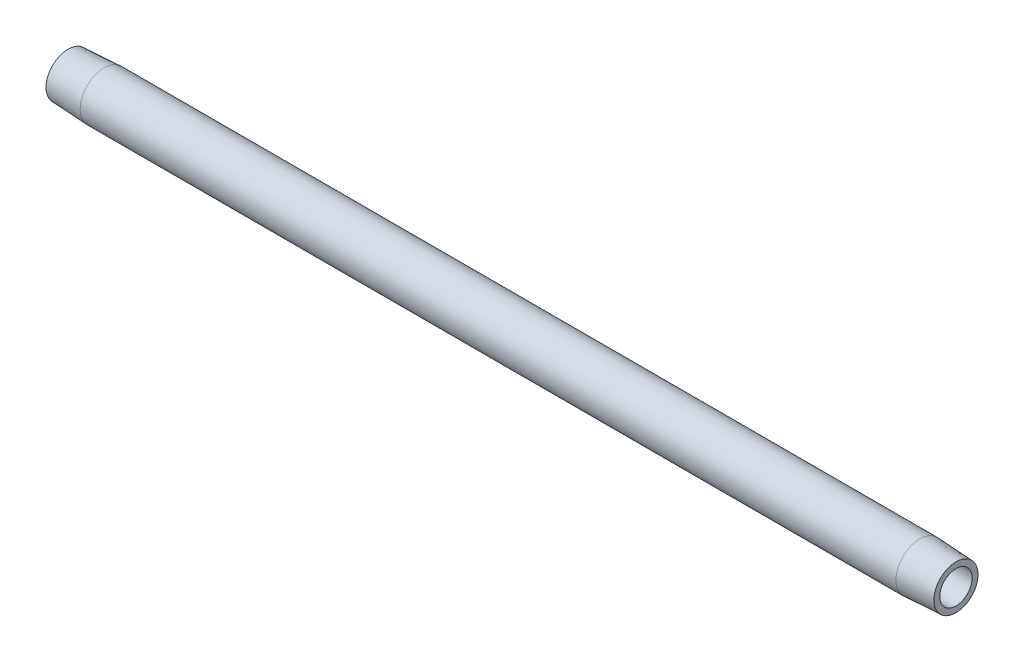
ISO-10303-21;
HEADER;
FILE_DESCRIPTION(('STEP AP214'),'2;1');
FILE_NAME('part.step','',(''),(''),'','','');
FILE_SCHEMA(('AUTOMOTIVE_DESIGN { 1 0 10303 214 1 1 1 1 }'));
ENDSEC;
DATA;
#1=APPLICATION_CONTEXT('core data for automotive mechanical design processes');
#2=APPLICATION_PROTOCOL_DEFINITION('international standard','automotive_design',2000,#1);
#3=PRODUCT_CONTEXT('',#1,'mechanical');
#4=PRODUCT('Part','Part','',(#3));
#5=PRODUCT_RELATED_PRODUCT_CATEGORY('part','',(#4));
#6=PRODUCT_DEFINITION_FORMATION('','',#4);
#7=PRODUCT_DEFINITION_CONTEXT('part definition',#1,'design');
#8=PRODUCT_DEFINITION('design','',#6,#7);
#9=PRODUCT_DEFINITION_SHAPE('','',#8);
#10=(LENGTH_UNIT() NAMED_UNIT(*) SI_UNIT(.MILLI.,.METRE.));
#11=(NAMED_UNIT(*) PLANE_ANGLE_UNIT() SI_UNIT($,.RADIAN.));
#12=(NAMED_UNIT(*) SI_UNIT($,.STERADIAN.) SOLID_ANGLE_UNIT());
#13=UNCERTAINTY_MEASURE_WITH_UNIT(LENGTH_MEASURE(1.E-05),#10,'distance_accuracy_value','');
#14=(GEOMETRIC_REPRESENTATION_CONTEXT(3) GLOBAL_UNCERTAINTY_ASSIGNED_CONTEXT((#13)) GLOBAL_UNIT_ASSIGNED_CONTEXT((#10,
#11,#12)) REPRESENTATION_CONTEXT('',''));
#15=CARTESIAN_POINT('',(0.,0.,0.));
#16=DIRECTION('',(0.,0.,1.));
#17=DIRECTION('',(1.,0.,0.));
#18=AXIS2_PLACEMENT_3D('',#15,#16,#17);
#19=CARTESIAN_POINT('',(254.,0.,-4.62277681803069));
#20=DIRECTION('',(-1.,0.,0.));
#21=DIRECTION('',(0.,0.,1.));
#22=AXIS2_PLACEMENT_3D('',#19,#20,#21);
#23=PLANE('',#22);
#24=CARTESIAN_POINT('',(254.,0.,0.));
#25=DIRECTION('',(-1.,0.,0.));
#26=DIRECTION('',(0.,0.,1.));
#27=AXIS2_PLACEMENT_3D('',#24,#25,#26);
#28=CIRCLE('',#27,6.31752683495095);
#29=CARTESIAN_POINT('',(254.,0.,6.31752683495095));
#30=VERTEX_POINT('',#29);
#31=EDGE_CURVE('E10',#30,#30,#28,.T.);
#32=ORIENTED_EDGE('',*,*,#31,.F.);
#33=EDGE_LOOP('',(#32));
#34=FACE_BOUND('',#33,.T.);
#35=CARTESIAN_POINT('',(254.,0.,0.));
#36=DIRECTION('',(-1.,0.,0.));
#37=DIRECTION('',(0.,0.,1.));
#38=AXIS2_PLACEMENT_3D('',#35,#36,#37);
#39=CIRCLE('',#38,4.62277681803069);
#40=CARTESIAN_POINT('',(254.,0.,4.62277681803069));
#41=VERTEX_POINT('',#40);
#42=EDGE_CURVE('E52',#41,#41,#39,.T.);
#43=ORIENTED_EDGE('',*,*,#42,.T.);
#44=EDGE_LOOP('',(#43));
#45=FACE_BOUND('',#44,.T.);
#46=ADVANCED_FACE('F30',(#34,#45),#23,.F.);
#47=CARTESIAN_POINT('',(254.,0.,0.));
#48=DIRECTION('',(-1.,0.,0.));
#49=DIRECTION('',(0.,0.,1.));
#50=AXIS2_PLACEMENT_3D('',#47,#48,#49);
#51=CONICAL_SURFACE('',#50,6.31752683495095,0.052359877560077);
#52=CARTESIAN_POINT('',(243.687600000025,0.,0.));
#53=DIRECTION('',(-1.,0.,0.));
#54=DIRECTION('',(0.,0.,1.));
#55=AXIS2_PLACEMENT_3D('',#52,#53,#54);
#56=CIRCLE('',#55,6.85797681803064);
#57=CARTESIAN_POINT('',(243.687600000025,0.,6.85797681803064));
#58=VERTEX_POINT('',#57);
#59=EDGE_CURVE('E36',#58,#58,#56,.T.);
#60=ORIENTED_EDGE('',*,*,#59,.F.);
#61=EDGE_LOOP('',(#60));
#62=FACE_BOUND('',#61,.T.);
#63=ORIENTED_EDGE('',*,*,#31,.T.);
#64=EDGE_LOOP('',(#63));
#65=FACE_BOUND('',#64,.T.);
#66=ADVANCED_FACE('F77',(#62,#65),#51,.T.);
#67=CARTESIAN_POINT('',(-6.37599469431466,0.,0.));
#68=DIRECTION('',(-1.,0.,0.));
#69=DIRECTION('',(0.,0.,1.));
#70=AXIS2_PLACEMENT_3D('',#67,#68,#69);
#71=CYLINDRICAL_SURFACE('',#70,6.85797681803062);
#72=CARTESIAN_POINT('',(10.3123999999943,0.,0.));
#73=DIRECTION('',(-1.,0.,0.));
#74=DIRECTION('',(0.,0.,1.));
#75=AXIS2_PLACEMENT_3D('',#72,#73,#74);
#76=CIRCLE('',#75,6.8579768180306);
#77=CARTESIAN_POINT('',(10.3123999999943,0.,6.8579768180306));
#78=VERTEX_POINT('',#77);
#79=EDGE_CURVE('E40',#78,#78,#76,.T.);
#80=ORIENTED_EDGE('',*,*,#79,.F.);
#81=EDGE_LOOP('',(#80));
#82=FACE_BOUND('',#81,.T.);
#83=ORIENTED_EDGE('',*,*,#59,.T.);
#84=EDGE_LOOP('',(#83));
#85=FACE_BOUND('',#84,.T.);
#86=ADVANCED_FACE('F72',(#82,#85),#71,.T.);
#87=CARTESIAN_POINT('',(10.3123999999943,0.,0.));
#88=DIRECTION('',(1.,0.,0.));
#89=DIRECTION('',(0.,0.,-1.));
#90=AXIS2_PLACEMENT_3D('',#87,#88,#89);
#91=CONICAL_SURFACE('',#90,6.8579768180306,0.0523598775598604);
#92=CARTESIAN_POINT('',(1.90819582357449E-11,0.,0.));
#93=DIRECTION('',(-1.,0.,0.));
#94=DIRECTION('',(0.,0.,1.));
#95=AXIS2_PLACEMENT_3D('',#92,#93,#94);
#96=CIRCLE('',#95,6.31752683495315);
#97=CARTESIAN_POINT('',(1.90819582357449E-11,0.,6.31752683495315));
#98=VERTEX_POINT('',#97);
#99=EDGE_CURVE('E44',#98,#98,#96,.T.);
#100=ORIENTED_EDGE('',*,*,#99,.F.);
#101=EDGE_LOOP('',(#100));
#102=FACE_BOUND('',#101,.T.);
#103=ORIENTED_EDGE('',*,*,#79,.T.);
#104=EDGE_LOOP('',(#103));
#105=FACE_BOUND('',#104,.T.);
#106=ADVANCED_FACE('F66',(#102,#105),#91,.T.);
#107=CARTESIAN_POINT('',(1.90819582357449E-11,0.,-6.31752683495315));
#108=DIRECTION('',(1.,0.,0.));
#109=DIRECTION('',(0.,0.,-1.));
#110=AXIS2_PLACEMENT_3D('',#107,#108,#109);
#111=PLANE('',#110);
#112=CARTESIAN_POINT('',(1.90819582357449E-11,0.,0.));
#113=DIRECTION('',(-1.,0.,0.));
#114=DIRECTION('',(0.,0.,1.));
#115=AXIS2_PLACEMENT_3D('',#112,#113,#114);
#116=CIRCLE('',#115,4.62277681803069);
#117=CARTESIAN_POINT('',(1.90819582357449E-11,0.,4.62277681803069));
#118=VERTEX_POINT('',#117);
#119=EDGE_CURVE('E49',#118,#118,#116,.T.);
#120=ORIENTED_EDGE('',*,*,#119,.F.);
#121=EDGE_LOOP('',(#120));
#122=FACE_BOUND('',#121,.T.);
#123=ORIENTED_EDGE('',*,*,#99,.T.);
#124=EDGE_LOOP('',(#123));
#125=FACE_BOUND('',#124,.T.);
#126=ADVANCED_FACE('F60',(#122,#125),#111,.F.);
#127=CARTESIAN_POINT('',(-6.37599469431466,0.,0.));
#128=DIRECTION('',(-1.,0.,0.));
#129=DIRECTION('',(0.,0.,1.));
#130=AXIS2_PLACEMENT_3D('',#127,#128,#129);
#131=CYLINDRICAL_SURFACE('',#130,4.62277681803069);
#132=ORIENTED_EDGE('',*,*,#42,.F.);
#133=EDGE_LOOP('',(#132));
#134=FACE_BOUND('',#133,.T.);
#135=ORIENTED_EDGE('',*,*,#119,.T.);
#136=EDGE_LOOP('',(#135));
#137=FACE_BOUND('',#136,.T.);
#138=ADVANCED_FACE('F57',(#134,#137),#131,.F.);
#139=CLOSED_SHELL('',(#46,#66,#86,#106,#126,#138));
#140=MANIFOLD_SOLID_BREP('B2',#139);
#141=ADVANCED_BREP_SHAPE_REPRESENTATION('',(#18,#140),#14);
#142=SHAPE_DEFINITION_REPRESENTATION(#9,#141);
ENDSEC;
END-ISO-10303-21;
